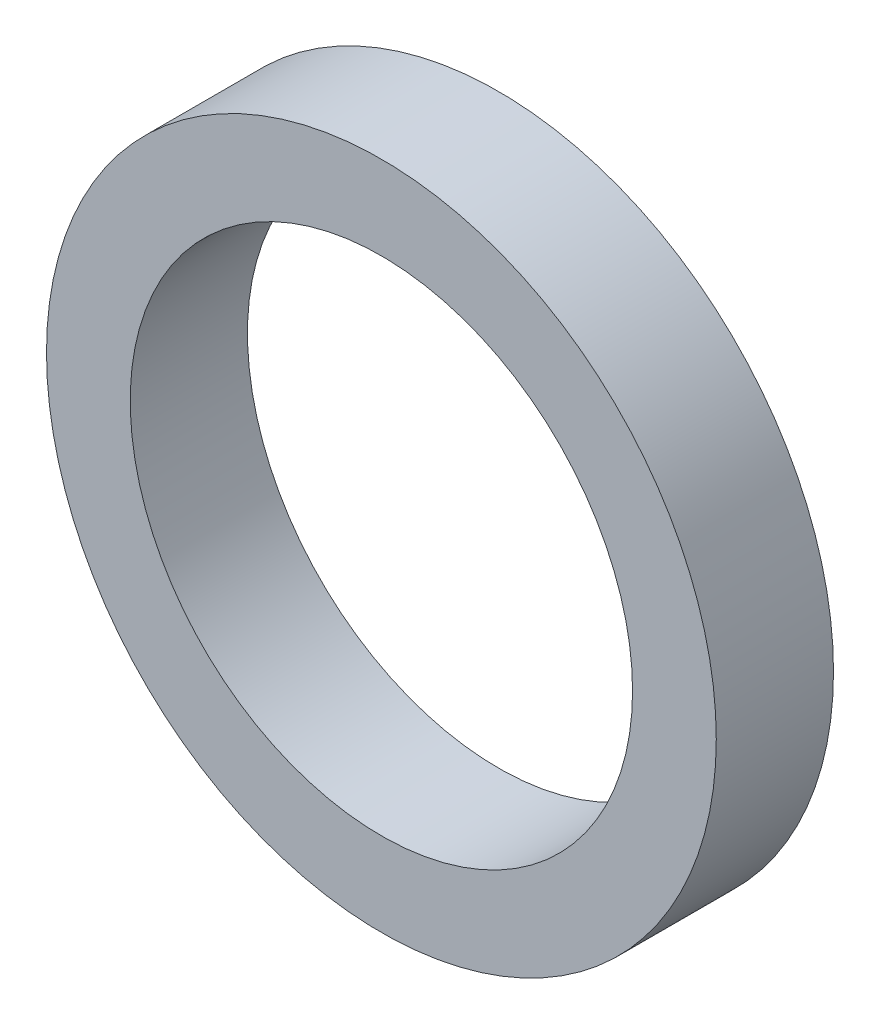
from build123d import *

# Parameters (mm, degrees)
ESQUISSE1_R   = 20
ESQUISSE1_R_2 = 15
BAGUE_DEPTH   = 7


with BuildPart() as part:
    # Esquisse1 → bague (new body)
    with BuildSketch(Plane.XY):
        Circle(ESQUISSE1_R)
        Circle(ESQUISSE1_R_2, mode=Mode.SUBTRACT)
    extrude(amount=BAGUE_DEPTH)


solid = part.part
